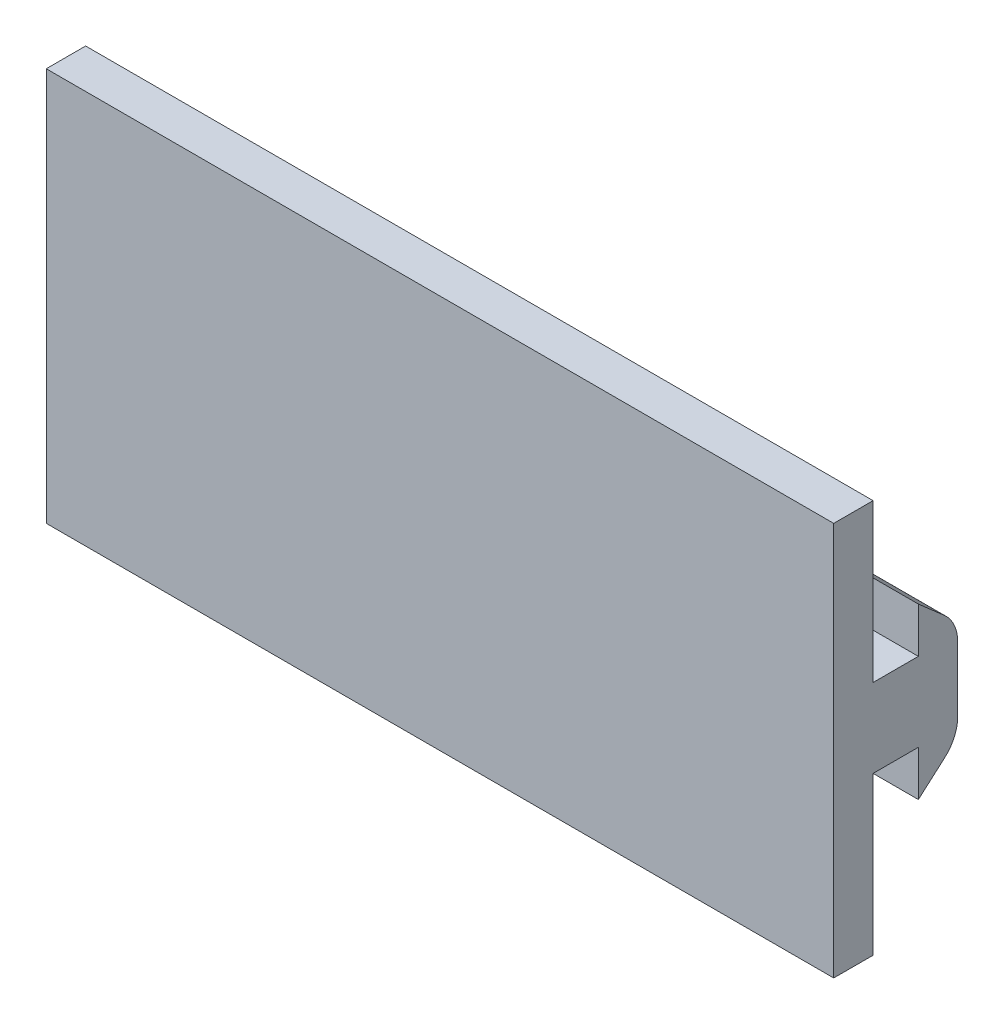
ISO-10303-21;
HEADER;
FILE_DESCRIPTION(('STEP AP214'),'2;1');
FILE_NAME('part.step','',(''),(''),'','','');
FILE_SCHEMA(('AUTOMOTIVE_DESIGN { 1 0 10303 214 1 1 1 1 }'));
ENDSEC;
DATA;
#1=APPLICATION_CONTEXT('core data for automotive mechanical design processes');
#2=APPLICATION_PROTOCOL_DEFINITION('international standard','automotive_design',2000,#1);
#3=PRODUCT_CONTEXT('',#1,'mechanical');
#4=PRODUCT('Part','Part','',(#3));
#5=PRODUCT_RELATED_PRODUCT_CATEGORY('part','',(#4));
#6=PRODUCT_DEFINITION_FORMATION('','',#4);
#7=PRODUCT_DEFINITION_CONTEXT('part definition',#1,'design');
#8=PRODUCT_DEFINITION('design','',#6,#7);
#9=PRODUCT_DEFINITION_SHAPE('','',#8);
#10=(LENGTH_UNIT() NAMED_UNIT(*) SI_UNIT(.MILLI.,.METRE.));
#11=(NAMED_UNIT(*) PLANE_ANGLE_UNIT() SI_UNIT($,.RADIAN.));
#12=(NAMED_UNIT(*) SI_UNIT($,.STERADIAN.) SOLID_ANGLE_UNIT());
#13=UNCERTAINTY_MEASURE_WITH_UNIT(LENGTH_MEASURE(1.E-05),#10,'distance_accuracy_value','');
#14=(GEOMETRIC_REPRESENTATION_CONTEXT(3) GLOBAL_UNCERTAINTY_ASSIGNED_CONTEXT((#13)) GLOBAL_UNIT_ASSIGNED_CONTEXT((#10,
#11,#12)) REPRESENTATION_CONTEXT('',''));
#15=CARTESIAN_POINT('',(0.,0.,0.));
#16=DIRECTION('',(0.,0.,1.));
#17=DIRECTION('',(1.,0.,0.));
#18=AXIS2_PLACEMENT_3D('',#15,#16,#17);
#19=CARTESIAN_POINT('',(0.,0.,0.));
#20=DIRECTION('',(0.,0.,-1.));
#21=DIRECTION('',(-1.,0.,0.));
#22=AXIS2_PLACEMENT_3D('',#19,#20,#21);
#23=PLANE('',#22);
#24=DIRECTION('',(0.,1.,0.));
#25=VECTOR('',#24,1.);
#26=CARTESIAN_POINT('',(8.89000000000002,0.,0.));
#27=LINE('',#26,#25);
#28=CARTESIAN_POINT('',(8.89000000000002,2.54,0.));
#29=VERTEX_POINT('',#28);
#30=CARTESIAN_POINT('',(8.89000000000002,12.7,0.));
#31=VERTEX_POINT('',#30);
#32=EDGE_CURVE('E239',#29,#31,#27,.T.);
#33=ORIENTED_EDGE('',*,*,#32,.F.);
#34=DIRECTION('',(-1.,0.,0.));
#35=VECTOR('',#34,1.);
#36=CARTESIAN_POINT('',(41.91,2.54,0.));
#37=LINE('',#36,#35);
#38=CARTESIAN_POINT('',(-41.91,2.54,0.));
#39=VERTEX_POINT('',#38);
#40=EDGE_CURVE('E212',#29,#39,#37,.T.);
#41=ORIENTED_EDGE('',*,*,#40,.T.);
#42=DIRECTION('',(0.,-1.,0.));
#43=VECTOR('',#42,1.);
#44=CARTESIAN_POINT('',(-41.91,-12.7,0.));
#45=LINE('',#44,#43);
#46=CARTESIAN_POINT('',(-41.91,12.7,0.));
#47=VERTEX_POINT('',#46);
#48=EDGE_CURVE('E217',#47,#39,#45,.T.);
#49=ORIENTED_EDGE('',*,*,#48,.F.);
#50=DIRECTION('',(-1.,0.,0.));
#51=VECTOR('',#50,1.);
#52=CARTESIAN_POINT('',(-41.91,12.7,0.));
#53=LINE('',#52,#51);
#54=EDGE_CURVE('E197',#31,#47,#53,.T.);
#55=ORIENTED_EDGE('',*,*,#54,.F.);
#56=EDGE_LOOP('',(#33,#41,#49,#55));
#57=FACE_BOUND('',#56,.T.);
#58=ADVANCED_FACE('F45',(#57),#23,.T.);
#59=CARTESIAN_POINT('',(-41.91,12.7,12.7));
#60=DIRECTION('',(0.,-1.,0.));
#61=DIRECTION('',(0.,0.,-1.));
#62=AXIS2_PLACEMENT_3D('',#59,#60,#61);
#63=PLANE('',#62);
#64=DIRECTION('',(-1.,0.,0.));
#65=VECTOR('',#64,1.);
#66=CARTESIAN_POINT('',(41.91,12.7,2.54));
#67=LINE('',#66,#65);
#68=CARTESIAN_POINT('',(8.89000000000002,12.7,2.54));
#69=VERTEX_POINT('',#68);
#70=CARTESIAN_POINT('',(-41.91,12.7,2.54));
#71=VERTEX_POINT('',#70);
#72=EDGE_CURVE('E161',#69,#71,#67,.T.);
#73=ORIENTED_EDGE('',*,*,#72,.F.);
#74=DIRECTION('',(0.,0.,1.));
#75=VECTOR('',#74,1.);
#76=CARTESIAN_POINT('',(8.89000000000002,12.7,-5.461));
#77=LINE('',#76,#75);
#78=EDGE_CURVE('E60',#31,#69,#77,.T.);
#79=ORIENTED_EDGE('',*,*,#78,.F.);
#80=ORIENTED_EDGE('',*,*,#54,.T.);
#81=DIRECTION('',(0.,0.,-1.));
#82=VECTOR('',#81,1.);
#83=CARTESIAN_POINT('',(-41.91,12.7,12.7));
#84=LINE('',#83,#82);
#85=EDGE_CURVE('E11',#71,#47,#84,.T.);
#86=ORIENTED_EDGE('',*,*,#85,.F.);
#87=EDGE_LOOP('',(#73,#79,#80,#86));
#88=FACE_BOUND('',#87,.T.);
#89=ADVANCED_FACE('F47',(#88),#63,.F.);
#90=CARTESIAN_POINT('',(-41.91,-12.7,12.7));
#91=DIRECTION('',(1.,0.,0.));
#92=DIRECTION('',(0.,0.,-1.));
#93=AXIS2_PLACEMENT_3D('',#90,#91,#92);
#94=PLANE('',#93);
#95=DIRECTION('',(0.,0.,-1.));
#96=VECTOR('',#95,1.);
#97=CARTESIAN_POINT('',(-41.91,-12.7,12.7));
#98=LINE('',#97,#96);
#99=CARTESIAN_POINT('',(-41.91,-12.7,2.54));
#100=VERTEX_POINT('',#99);
#101=CARTESIAN_POINT('',(-41.91,-12.7,0.));
#102=VERTEX_POINT('',#101);
#103=EDGE_CURVE('E53',#100,#102,#98,.T.);
#104=ORIENTED_EDGE('',*,*,#103,.F.);
#105=DIRECTION('',(0.,-1.,0.));
#106=VECTOR('',#105,1.);
#107=CARTESIAN_POINT('',(-41.91,12.7,2.54));
#108=LINE('',#107,#106);
#109=EDGE_CURVE('E159',#71,#100,#108,.T.);
#110=ORIENTED_EDGE('',*,*,#109,.F.);
#111=ORIENTED_EDGE('',*,*,#85,.T.);
#112=ORIENTED_EDGE('',*,*,#48,.T.);
#113=DIRECTION('',(0.,0.,-1.));
#114=VECTOR('',#113,1.);
#115=CARTESIAN_POINT('',(-41.91,2.54,-2.921));
#116=LINE('',#115,#114);
#117=CARTESIAN_POINT('',(-41.91,2.54,-2.921));
#118=VERTEX_POINT('',#117);
#119=EDGE_CURVE('E170',#39,#118,#116,.T.);
#120=ORIENTED_EDGE('',*,*,#119,.T.);
#121=DIRECTION('',(0.,1.,0.));
#122=VECTOR('',#121,1.);
#123=CARTESIAN_POINT('',(-41.91,5.461,-2.921));
#124=LINE('',#123,#122);
#125=CARTESIAN_POINT('',(-41.91,5.461,-2.921));
#126=VERTEX_POINT('',#125);
#127=EDGE_CURVE('E173',#118,#126,#124,.T.);
#128=ORIENTED_EDGE('',*,*,#127,.T.);
#129=DIRECTION('',(0.,-0.658748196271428,-0.752363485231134));
#130=VECTOR('',#129,1.);
#131=CARTESIAN_POINT('',(-41.91,3.99597550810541,-4.59422041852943));
#132=LINE('',#131,#130);
#133=CARTESIAN_POINT('',(-41.91,3.99597550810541,-4.59422041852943));
#134=VERTEX_POINT('',#133);
#135=EDGE_CURVE('E176',#126,#134,#132,.T.);
#136=ORIENTED_EDGE('',*,*,#135,.T.);
#137=CARTESIAN_POINT('',(-41.91,2.08497225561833,-2.921));
#138=DIRECTION('',(-1.,0.,0.));
#139=DIRECTION('',(0.,0.,1.));
#140=AXIS2_PLACEMENT_3D('',#137,#138,#139);
#141=CIRCLE('',#140,2.54);
#142=CARTESIAN_POINT('',(-41.91,2.08497225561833,-5.461));
#143=VERTEX_POINT('',#142);
#144=EDGE_CURVE('E179',#134,#143,#141,.T.);
#145=ORIENTED_EDGE('',*,*,#144,.T.);
#146=DIRECTION('',(0.,-1.,0.));
#147=VECTOR('',#146,1.);
#148=CARTESIAN_POINT('',(-41.91,2.08497225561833,-5.461));
#149=LINE('',#148,#147);
#150=CARTESIAN_POINT('',(-41.91,-2.08497225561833,-5.461));
#151=VERTEX_POINT('',#150);
#152=EDGE_CURVE('E182',#143,#151,#149,.T.);
#153=ORIENTED_EDGE('',*,*,#152,.T.);
#154=CARTESIAN_POINT('',(-41.91,-2.08497225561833,-2.921));
#155=DIRECTION('',(-1.,0.,0.));
#156=DIRECTION('',(0.,0.,1.));
#157=AXIS2_PLACEMENT_3D('',#154,#155,#156);
#158=CIRCLE('',#157,2.54);
#159=CARTESIAN_POINT('',(-41.91,-3.99597550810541,-4.59422041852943));
#160=VERTEX_POINT('',#159);
#161=EDGE_CURVE('E185',#151,#160,#158,.T.);
#162=ORIENTED_EDGE('',*,*,#161,.T.);
#163=DIRECTION('',(0.,-0.658748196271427,0.752363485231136));
#164=VECTOR('',#163,1.);
#165=CARTESIAN_POINT('',(-41.91,-3.99597550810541,-4.59422041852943));
#166=LINE('',#165,#164);
#167=CARTESIAN_POINT('',(-41.91,-5.46099999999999,-2.921));
#168=VERTEX_POINT('',#167);
#169=EDGE_CURVE('E188',#160,#168,#166,.T.);
#170=ORIENTED_EDGE('',*,*,#169,.T.);
#171=DIRECTION('',(0.,1.,0.));
#172=VECTOR('',#171,1.);
#173=CARTESIAN_POINT('',(-41.91,-5.46099999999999,-2.921));
#174=LINE('',#173,#172);
#175=CARTESIAN_POINT('',(-41.91,-2.54,-2.921));
#176=VERTEX_POINT('',#175);
#177=EDGE_CURVE('E191',#168,#176,#174,.T.);
#178=ORIENTED_EDGE('',*,*,#177,.T.);
#179=DIRECTION('',(0.,0.,1.));
#180=VECTOR('',#179,1.);
#181=CARTESIAN_POINT('',(-41.91,-2.54,-2.921));
#182=LINE('',#181,#180);
#183=CARTESIAN_POINT('',(-41.91,-2.54,0.));
#184=VERTEX_POINT('',#183);
#185=EDGE_CURVE('E163',#176,#184,#182,.T.);
#186=ORIENTED_EDGE('',*,*,#185,.T.);
#187=EDGE_CURVE('E216',#184,#102,#45,.T.);
#188=ORIENTED_EDGE('',*,*,#187,.T.);
#189=EDGE_LOOP('',(#104,#110,#111,#112,#120,#128,#136,#145,#153,#162,#170,#178,#186,#188));
#190=FACE_BOUND('',#189,.T.);
#191=ADVANCED_FACE('F223',(#190),#94,.F.);
#192=CARTESIAN_POINT('',(-41.91,-12.7,12.7));
#193=DIRECTION('',(0.,1.,0.));
#194=DIRECTION('',(0.,0.,1.));
#195=AXIS2_PLACEMENT_3D('',#192,#193,#194);
#196=PLANE('',#195);
#197=DIRECTION('',(1.,0.,0.));
#198=VECTOR('',#197,1.);
#199=CARTESIAN_POINT('',(-41.91,-12.7,0.));
#200=LINE('',#199,#198);
#201=CARTESIAN_POINT('',(8.89000000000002,-12.7,0.));
#202=VERTEX_POINT('',#201);
#203=EDGE_CURVE('E155',#102,#202,#200,.T.);
#204=ORIENTED_EDGE('',*,*,#203,.T.);
#205=DIRECTION('',(0.,0.,1.));
#206=VECTOR('',#205,1.);
#207=CARTESIAN_POINT('',(8.89000000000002,-12.7,-5.461));
#208=LINE('',#207,#206);
#209=CARTESIAN_POINT('',(8.89000000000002,-12.7,2.54));
#210=VERTEX_POINT('',#209);
#211=EDGE_CURVE('E146',#202,#210,#208,.T.);
#212=ORIENTED_EDGE('',*,*,#211,.T.);
#213=DIRECTION('',(-1.,0.,0.));
#214=VECTOR('',#213,1.);
#215=CARTESIAN_POINT('',(41.91,-12.7,2.54));
#216=LINE('',#215,#214);
#217=EDGE_CURVE('E68',#210,#100,#216,.T.);
#218=ORIENTED_EDGE('',*,*,#217,.T.);
#219=ORIENTED_EDGE('',*,*,#103,.T.);
#220=EDGE_LOOP('',(#204,#212,#218,#219));
#221=FACE_BOUND('',#220,.T.);
#222=ADVANCED_FACE('F153',(#221),#196,.F.);
#223=DIRECTION('',(0.,1.,0.));
#224=VECTOR('',#223,1.);
#225=CARTESIAN_POINT('',(8.89000000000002,0.,0.));
#226=LINE('',#225,#224);
#227=CARTESIAN_POINT('',(8.89000000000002,-2.54,0.));
#228=VERTEX_POINT('',#227);
#229=EDGE_CURVE('E165',#202,#228,#226,.T.);
#230=ORIENTED_EDGE('',*,*,#229,.F.);
#231=ORIENTED_EDGE('',*,*,#203,.F.);
#232=ORIENTED_EDGE('',*,*,#187,.F.);
#233=DIRECTION('',(-1.,0.,0.));
#234=VECTOR('',#233,1.);
#235=CARTESIAN_POINT('',(41.91,-2.54,0.));
#236=LINE('',#235,#234);
#237=EDGE_CURVE('E194',#228,#184,#236,.T.);
#238=ORIENTED_EDGE('',*,*,#237,.F.);
#239=EDGE_LOOP('',(#230,#231,#232,#238));
#240=FACE_BOUND('',#239,.T.);
#241=ADVANCED_FACE('F227',(#240),#23,.T.);
#242=CARTESIAN_POINT('',(41.91,-2.54,-2.921));
#243=DIRECTION('',(0.,-1.,0.));
#244=DIRECTION('',(0.,0.,-1.));
#245=AXIS2_PLACEMENT_3D('',#242,#243,#244);
#246=PLANE('',#245);
#247=DIRECTION('',(0.,0.,-1.));
#248=VECTOR('',#247,1.);
#249=CARTESIAN_POINT('',(8.89000000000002,-2.54,-2.921));
#250=LINE('',#249,#248);
#251=CARTESIAN_POINT('',(8.89000000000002,-2.54,-2.921));
#252=VERTEX_POINT('',#251);
#253=EDGE_CURVE('E229',#228,#252,#250,.T.);
#254=ORIENTED_EDGE('',*,*,#253,.F.);
#255=ORIENTED_EDGE('',*,*,#237,.T.);
#256=ORIENTED_EDGE('',*,*,#185,.F.);
#257=DIRECTION('',(-1.,0.,0.));
#258=VECTOR('',#257,1.);
#259=CARTESIAN_POINT('',(41.91,-2.54,-2.921));
#260=LINE('',#259,#258);
#261=EDGE_CURVE('E195',#252,#176,#260,.T.);
#262=ORIENTED_EDGE('',*,*,#261,.F.);
#263=EDGE_LOOP('',(#254,#255,#256,#262));
#264=FACE_BOUND('',#263,.T.);
#265=ADVANCED_FACE('F300',(#264),#246,.T.);
#266=CARTESIAN_POINT('',(41.91,-5.46099999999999,-2.921));
#267=DIRECTION('',(0.,0.,1.));
#268=DIRECTION('',(0.,-1.,0.));
#269=AXIS2_PLACEMENT_3D('',#266,#267,#268);
#270=PLANE('',#269);
#271=DIRECTION('',(0.,-1.,0.));
#272=VECTOR('',#271,1.);
#273=CARTESIAN_POINT('',(8.89000000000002,-5.461,-2.921));
#274=LINE('',#273,#272);
#275=CARTESIAN_POINT('',(8.89000000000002,-5.46099999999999,-2.921));
#276=VERTEX_POINT('',#275);
#277=EDGE_CURVE('E231',#252,#276,#274,.T.);
#278=ORIENTED_EDGE('',*,*,#277,.F.);
#279=ORIENTED_EDGE('',*,*,#261,.T.);
#280=ORIENTED_EDGE('',*,*,#177,.F.);
#281=DIRECTION('',(-1.,0.,0.));
#282=VECTOR('',#281,1.);
#283=CARTESIAN_POINT('',(41.91,-5.46099999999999,-2.921));
#284=LINE('',#283,#282);
#285=EDGE_CURVE('E198',#276,#168,#284,.T.);
#286=ORIENTED_EDGE('',*,*,#285,.F.);
#287=EDGE_LOOP('',(#278,#279,#280,#286));
#288=FACE_BOUND('',#287,.T.);
#289=ADVANCED_FACE('F304',(#288),#270,.T.);
#290=CARTESIAN_POINT('',(41.91,-3.99597550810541,-4.59422041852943));
#291=DIRECTION('',(0.,-0.752363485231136,-0.658748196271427));
#292=DIRECTION('',(0.,0.658748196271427,-0.752363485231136));
#293=AXIS2_PLACEMENT_3D('',#290,#291,#292);
#294=PLANE('',#293);
#295=DIRECTION('',(0.,0.658748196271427,-0.752363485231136));
#296=VECTOR('',#295,1.);
#297=CARTESIAN_POINT('',(8.89000000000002,-3.99597550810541,-4.59422041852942));
#298=LINE('',#297,#296);
#299=CARTESIAN_POINT('',(8.89000000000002,-3.99597550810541,-4.59422041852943));
#300=VERTEX_POINT('',#299);
#301=EDGE_CURVE('E235',#276,#300,#298,.T.);
#302=ORIENTED_EDGE('',*,*,#301,.F.);
#303=ORIENTED_EDGE('',*,*,#285,.T.);
#304=ORIENTED_EDGE('',*,*,#169,.F.);
#305=DIRECTION('',(-1.,0.,0.));
#306=VECTOR('',#305,1.);
#307=CARTESIAN_POINT('',(41.91,-3.99597550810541,-4.59422041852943));
#308=LINE('',#307,#306);
#309=EDGE_CURVE('E200',#300,#160,#308,.T.);
#310=ORIENTED_EDGE('',*,*,#309,.F.);
#311=EDGE_LOOP('',(#302,#303,#304,#310));
#312=FACE_BOUND('',#311,.T.);
#313=ADVANCED_FACE('F342',(#312),#294,.T.);
#314=CARTESIAN_POINT('',(41.91,-2.08497225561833,-2.921));
#315=DIRECTION('',(-1.,0.,0.));
#316=DIRECTION('',(0.,0.,1.));
#317=AXIS2_PLACEMENT_3D('',#314,#315,#316);
#318=CYLINDRICAL_SURFACE('',#317,2.54);
#319=CARTESIAN_POINT('',(8.89000000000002,-2.08497225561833,-2.921));
#320=DIRECTION('',(-1.,0.,0.));
#321=DIRECTION('',(0.,-1.,0.));
#322=AXIS2_PLACEMENT_3D('',#319,#320,#321);
#323=CIRCLE('',#322,2.54);
#324=CARTESIAN_POINT('',(8.89000000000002,-2.08497225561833,-5.461));
#325=VERTEX_POINT('',#324);
#326=EDGE_CURVE('E237',#300,#325,#323,.F.);
#327=ORIENTED_EDGE('',*,*,#326,.F.);
#328=ORIENTED_EDGE('',*,*,#309,.T.);
#329=ORIENTED_EDGE('',*,*,#161,.F.);
#330=DIRECTION('',(-1.,0.,0.));
#331=VECTOR('',#330,1.);
#332=CARTESIAN_POINT('',(41.91,-2.08497225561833,-5.461));
#333=LINE('',#332,#331);
#334=EDGE_CURVE('E202',#325,#151,#333,.T.);
#335=ORIENTED_EDGE('',*,*,#334,.F.);
#336=EDGE_LOOP('',(#327,#328,#329,#335));
#337=FACE_BOUND('',#336,.T.);
#338=ADVANCED_FACE('F260',(#337),#318,.T.);
#339=CARTESIAN_POINT('',(41.91,2.08497225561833,-5.461));
#340=DIRECTION('',(0.,0.,-1.));
#341=DIRECTION('',(-1.,0.,0.));
#342=AXIS2_PLACEMENT_3D('',#339,#340,#341);
#343=PLANE('',#342);
#344=DIRECTION('',(0.,-1.,0.));
#345=VECTOR('',#344,1.);
#346=CARTESIAN_POINT('',(8.89000000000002,12.7,-5.461));
#347=LINE('',#346,#345);
#348=CARTESIAN_POINT('',(8.89000000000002,2.08497225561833,-5.461));
#349=VERTEX_POINT('',#348);
#350=EDGE_CURVE('E150',#349,#325,#347,.T.);
#351=ORIENTED_EDGE('',*,*,#350,.T.);
#352=ORIENTED_EDGE('',*,*,#334,.T.);
#353=ORIENTED_EDGE('',*,*,#152,.F.);
#354=DIRECTION('',(-1.,0.,0.));
#355=VECTOR('',#354,1.);
#356=CARTESIAN_POINT('',(41.91,2.08497225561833,-5.461));
#357=LINE('',#356,#355);
#358=EDGE_CURVE('E204',#349,#143,#357,.T.);
#359=ORIENTED_EDGE('',*,*,#358,.F.);
#360=EDGE_LOOP('',(#351,#352,#353,#359));
#361=FACE_BOUND('',#360,.T.);
#362=ADVANCED_FACE('F254',(#361),#343,.T.);
#363=CARTESIAN_POINT('',(41.91,2.08497225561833,-2.921));
#364=DIRECTION('',(-1.,0.,0.));
#365=DIRECTION('',(0.,0.,1.));
#366=AXIS2_PLACEMENT_3D('',#363,#364,#365);
#367=CYLINDRICAL_SURFACE('',#366,2.54);
#368=CARTESIAN_POINT('',(8.89000000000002,2.08497225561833,-2.921));
#369=DIRECTION('',(-1.,0.,0.));
#370=DIRECTION('',(0.,-1.,0.));
#371=AXIS2_PLACEMENT_3D('',#368,#369,#370);
#372=CIRCLE('',#371,2.54);
#373=CARTESIAN_POINT('',(8.89000000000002,3.99597550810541,-4.59422041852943));
#374=VERTEX_POINT('',#373);
#375=EDGE_CURVE('E241',#349,#374,#372,.F.);
#376=ORIENTED_EDGE('',*,*,#375,.F.);
#377=ORIENTED_EDGE('',*,*,#358,.T.);
#378=ORIENTED_EDGE('',*,*,#144,.F.);
#379=DIRECTION('',(-1.,0.,0.));
#380=VECTOR('',#379,1.);
#381=CARTESIAN_POINT('',(41.91,3.99597550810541,-4.59422041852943));
#382=LINE('',#381,#380);
#383=EDGE_CURVE('E206',#374,#134,#382,.T.);
#384=ORIENTED_EDGE('',*,*,#383,.F.);
#385=EDGE_LOOP('',(#376,#377,#378,#384));
#386=FACE_BOUND('',#385,.T.);
#387=ADVANCED_FACE('F267',(#386),#367,.T.);
#388=CARTESIAN_POINT('',(41.91,3.99597550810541,-4.59422041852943));
#389=DIRECTION('',(0.,0.752363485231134,-0.658748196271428));
#390=DIRECTION('',(0.,0.658748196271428,0.752363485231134));
#391=AXIS2_PLACEMENT_3D('',#388,#389,#390);
#392=PLANE('',#391);
#393=DIRECTION('',(0.,0.658748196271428,0.752363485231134));
#394=VECTOR('',#393,1.);
#395=CARTESIAN_POINT('',(8.89000000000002,3.99597550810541,-4.59422041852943));
#396=LINE('',#395,#394);
#397=CARTESIAN_POINT('',(8.89000000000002,5.461,-2.921));
#398=VERTEX_POINT('',#397);
#399=EDGE_CURVE('E243',#374,#398,#396,.T.);
#400=ORIENTED_EDGE('',*,*,#399,.F.);
#401=ORIENTED_EDGE('',*,*,#383,.T.);
#402=ORIENTED_EDGE('',*,*,#135,.F.);
#403=DIRECTION('',(-1.,0.,0.));
#404=VECTOR('',#403,1.);
#405=CARTESIAN_POINT('',(41.91,5.461,-2.921));
#406=LINE('',#405,#404);
#407=EDGE_CURVE('E208',#398,#126,#406,.T.);
#408=ORIENTED_EDGE('',*,*,#407,.F.);
#409=EDGE_LOOP('',(#400,#401,#402,#408));
#410=FACE_BOUND('',#409,.T.);
#411=ADVANCED_FACE('F272',(#410),#392,.T.);
#412=CARTESIAN_POINT('',(41.91,5.461,-2.921));
#413=DIRECTION('',(0.,0.,1.));
#414=DIRECTION('',(0.,-1.,0.));
#415=AXIS2_PLACEMENT_3D('',#412,#413,#414);
#416=PLANE('',#415);
#417=DIRECTION('',(0.,-1.,0.));
#418=VECTOR('',#417,1.);
#419=CARTESIAN_POINT('',(8.89000000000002,5.461,-2.921));
#420=LINE('',#419,#418);
#421=CARTESIAN_POINT('',(8.89000000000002,2.54,-2.921));
#422=VERTEX_POINT('',#421);
#423=EDGE_CURVE('E245',#398,#422,#420,.T.);
#424=ORIENTED_EDGE('',*,*,#423,.F.);
#425=ORIENTED_EDGE('',*,*,#407,.T.);
#426=ORIENTED_EDGE('',*,*,#127,.F.);
#427=DIRECTION('',(-1.,0.,0.));
#428=VECTOR('',#427,1.);
#429=CARTESIAN_POINT('',(41.91,2.54,-2.921));
#430=LINE('',#429,#428);
#431=EDGE_CURVE('E210',#422,#118,#430,.T.);
#432=ORIENTED_EDGE('',*,*,#431,.F.);
#433=EDGE_LOOP('',(#424,#425,#426,#432));
#434=FACE_BOUND('',#433,.T.);
#435=ADVANCED_FACE('F275',(#434),#416,.T.);
#436=CARTESIAN_POINT('',(41.91,2.54,-2.921));
#437=DIRECTION('',(0.,1.,0.));
#438=DIRECTION('',(0.,0.,1.));
#439=AXIS2_PLACEMENT_3D('',#436,#437,#438);
#440=PLANE('',#439);
#441=DIRECTION('',(0.,0.,1.));
#442=VECTOR('',#441,1.);
#443=CARTESIAN_POINT('',(8.89000000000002,2.54,-2.921));
#444=LINE('',#443,#442);
#445=EDGE_CURVE('E247',#422,#29,#444,.T.);
#446=ORIENTED_EDGE('',*,*,#445,.F.);
#447=ORIENTED_EDGE('',*,*,#431,.T.);
#448=ORIENTED_EDGE('',*,*,#119,.F.);
#449=ORIENTED_EDGE('',*,*,#40,.F.);
#450=EDGE_LOOP('',(#446,#447,#448,#449));
#451=FACE_BOUND('',#450,.T.);
#452=ADVANCED_FACE('F281',(#451),#440,.T.);
#453=CARTESIAN_POINT('',(41.91,12.7,2.54));
#454=DIRECTION('',(0.,0.,-1.));
#455=DIRECTION('',(0.,1.,0.));
#456=AXIS2_PLACEMENT_3D('',#453,#454,#455);
#457=PLANE('',#456);
#458=ORIENTED_EDGE('',*,*,#217,.F.);
#459=DIRECTION('',(0.,-1.,0.));
#460=VECTOR('',#459,1.);
#461=CARTESIAN_POINT('',(8.89000000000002,12.7,2.54));
#462=LINE('',#461,#460);
#463=EDGE_CURVE('E144',#69,#210,#462,.T.);
#464=ORIENTED_EDGE('',*,*,#463,.F.);
#465=ORIENTED_EDGE('',*,*,#72,.T.);
#466=ORIENTED_EDGE('',*,*,#109,.T.);
#467=EDGE_LOOP('',(#458,#464,#465,#466));
#468=FACE_BOUND('',#467,.T.);
#469=ADVANCED_FACE('F157',(#468),#457,.F.);
#470=CARTESIAN_POINT('',(8.89000000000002,12.7,-5.461));
#471=DIRECTION('',(-1.,0.,0.));
#472=DIRECTION('',(0.,-1.,0.));
#473=AXIS2_PLACEMENT_3D('',#470,#471,#472);
#474=PLANE('',#473);
#475=ORIENTED_EDGE('',*,*,#229,.T.);
#476=ORIENTED_EDGE('',*,*,#253,.T.);
#477=ORIENTED_EDGE('',*,*,#277,.T.);
#478=ORIENTED_EDGE('',*,*,#301,.T.);
#479=ORIENTED_EDGE('',*,*,#326,.T.);
#480=ORIENTED_EDGE('',*,*,#350,.F.);
#481=ORIENTED_EDGE('',*,*,#375,.T.);
#482=ORIENTED_EDGE('',*,*,#399,.T.);
#483=ORIENTED_EDGE('',*,*,#423,.T.);
#484=ORIENTED_EDGE('',*,*,#445,.T.);
#485=ORIENTED_EDGE('',*,*,#32,.T.);
#486=ORIENTED_EDGE('',*,*,#78,.T.);
#487=ORIENTED_EDGE('',*,*,#463,.T.);
#488=ORIENTED_EDGE('',*,*,#211,.F.);
#489=EDGE_LOOP('',(#475,#476,#477,#478,#479,#480,#481,#482,#483,#484,#485,#486,#487,#488));
#490=FACE_BOUND('',#489,.T.);
#491=ADVANCED_FACE('F145',(#490),#474,.F.);
#492=CLOSED_SHELL('',(#58,#89,#191,#222,#241,#265,#289,#313,#338,#362,#387,#411,#435,#452,#469,#491));
#493=MANIFOLD_SOLID_BREP('B2',#492);
#494=ADVANCED_BREP_SHAPE_REPRESENTATION('',(#18,#493),#14);
#495=SHAPE_DEFINITION_REPRESENTATION(#9,#494);
ENDSEC;
END-ISO-10303-21;
